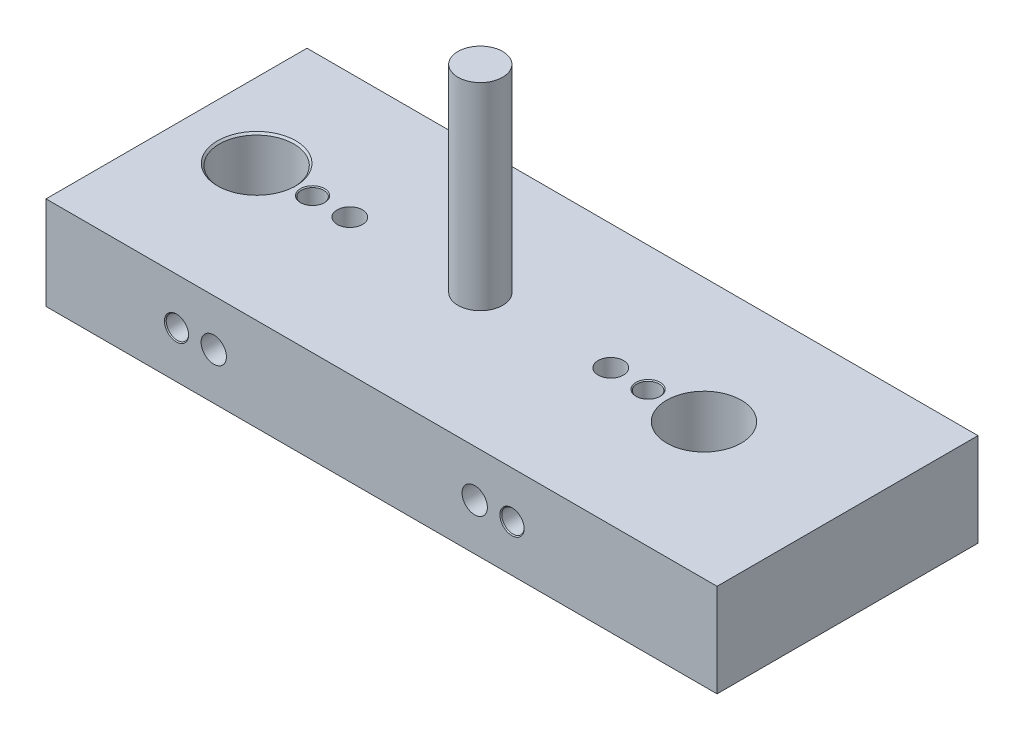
ISO-10303-21;
HEADER;
FILE_DESCRIPTION(('STEP AP214'),'2;1');
FILE_NAME('part.step','',(''),(''),'','','');
FILE_SCHEMA(('AUTOMOTIVE_DESIGN { 1 0 10303 214 1 1 1 1 }'));
ENDSEC;
DATA;
#1=APPLICATION_CONTEXT('core data for automotive mechanical design processes');
#2=APPLICATION_PROTOCOL_DEFINITION('international standard','automotive_design',2000,#1);
#3=PRODUCT_CONTEXT('',#1,'mechanical');
#4=PRODUCT('Part','Part','',(#3));
#5=PRODUCT_RELATED_PRODUCT_CATEGORY('part','',(#4));
#6=PRODUCT_DEFINITION_FORMATION('','',#4);
#7=PRODUCT_DEFINITION_CONTEXT('part definition',#1,'design');
#8=PRODUCT_DEFINITION('design','',#6,#7);
#9=PRODUCT_DEFINITION_SHAPE('','',#8);
#10=(LENGTH_UNIT() NAMED_UNIT(*) SI_UNIT(.MILLI.,.METRE.));
#11=(NAMED_UNIT(*) PLANE_ANGLE_UNIT() SI_UNIT($,.RADIAN.));
#12=(NAMED_UNIT(*) SI_UNIT($,.STERADIAN.) SOLID_ANGLE_UNIT());
#13=UNCERTAINTY_MEASURE_WITH_UNIT(LENGTH_MEASURE(1.E-05),#10,'distance_accuracy_value','');
#14=(GEOMETRIC_REPRESENTATION_CONTEXT(3) GLOBAL_UNCERTAINTY_ASSIGNED_CONTEXT((#13)) GLOBAL_UNIT_ASSIGNED_CONTEXT((#10,
#11,#12)) REPRESENTATION_CONTEXT('',''));
#15=CARTESIAN_POINT('',(0.,0.,0.));
#16=DIRECTION('',(0.,0.,1.));
#17=DIRECTION('',(1.,0.,0.));
#18=AXIS2_PLACEMENT_3D('',#15,#16,#17);
#19=CARTESIAN_POINT('',(0.,25.,-70.));
#20=DIRECTION('',(0.,-1.,0.));
#21=DIRECTION('',(0.,0.,-1.));
#22=AXIS2_PLACEMENT_3D('',#19,#20,#21);
#23=PLANE('',#22);
#24=CARTESIAN_POINT('',(140.,25.,-36.5));
#25=DIRECTION('',(0.,-1.,0.));
#26=DIRECTION('',(0.,0.,-1.));
#27=AXIS2_PLACEMENT_3D('',#24,#25,#26);
#28=CIRCLE('',#27,9.99999999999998);
#29=CARTESIAN_POINT('',(140.,25.,-46.5));
#30=VERTEX_POINT('',#29);
#31=EDGE_CURVE('E9178',#30,#30,#28,.T.);
#32=ORIENTED_EDGE('',*,*,#31,.T.);
#33=EDGE_LOOP('',(#32));
#34=FACE_BOUND('',#33,.T.);
#35=DIRECTION('',(0.,0.,1.));
#36=VECTOR('',#35,1.);
#37=CARTESIAN_POINT('',(0.,25.,0.));
#38=LINE('',#37,#36);
#39=CARTESIAN_POINT('',(0.,25.,-70.));
#40=VERTEX_POINT('',#39);
#41=CARTESIAN_POINT('',(0.,25.,0.));
#42=VERTEX_POINT('',#41);
#43=EDGE_CURVE('E9306',#40,#42,#38,.T.);
#44=ORIENTED_EDGE('',*,*,#43,.T.);
#45=DIRECTION('',(1.,0.,0.));
#46=VECTOR('',#45,1.);
#47=CARTESIAN_POINT('',(0.,25.,0.));
#48=LINE('',#47,#46);
#49=CARTESIAN_POINT('',(180.,25.,0.));
#50=VERTEX_POINT('',#49);
#51=EDGE_CURVE('E9304',#42,#50,#48,.T.);
#52=ORIENTED_EDGE('',*,*,#51,.T.);
#53=DIRECTION('',(0.,0.,-1.));
#54=VECTOR('',#53,1.);
#55=CARTESIAN_POINT('',(180.,25.,0.));
#56=LINE('',#55,#54);
#57=CARTESIAN_POINT('',(180.,25.,-70.));
#58=VERTEX_POINT('',#57);
#59=EDGE_CURVE('E9302',#50,#58,#56,.T.);
#60=ORIENTED_EDGE('',*,*,#59,.T.);
#61=DIRECTION('',(-1.,0.,0.));
#62=VECTOR('',#61,1.);
#63=CARTESIAN_POINT('',(0.,25.,-70.));
#64=LINE('',#63,#62);
#65=EDGE_CURVE('E9300',#58,#40,#64,.T.);
#66=ORIENTED_EDGE('',*,*,#65,.T.);
#67=EDGE_LOOP('',(#44,#52,#60,#66));
#68=FACE_BOUND('',#67,.T.);
#69=CARTESIAN_POINT('',(20.,25.,-36.5));
#70=DIRECTION('',(0.,-1.,0.));
#71=DIRECTION('',(0.,0.,-1.));
#72=AXIS2_PLACEMENT_3D('',#69,#70,#71);
#73=CIRCLE('',#72,10.5);
#74=CARTESIAN_POINT('',(20.,25.,-47.));
#75=VERTEX_POINT('',#74);
#76=EDGE_CURVE('E9327',#75,#75,#73,.T.);
#77=ORIENTED_EDGE('',*,*,#76,.T.);
#78=EDGE_LOOP('',(#77));
#79=FACE_BOUND('',#78,.T.);
#80=CARTESIAN_POINT('',(45.,25.,-36.5));
#81=DIRECTION('',(0.,-1.,0.));
#82=DIRECTION('',(0.,0.,-1.));
#83=AXIS2_PLACEMENT_3D('',#80,#81,#82);
#84=CIRCLE('',#83,3.39999999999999);
#85=CARTESIAN_POINT('',(45.,25.,-39.9));
#86=VERTEX_POINT('',#85);
#87=EDGE_CURVE('E9333',#86,#86,#84,.T.);
#88=ORIENTED_EDGE('',*,*,#87,.T.);
#89=EDGE_LOOP('',(#88));
#90=FACE_BOUND('',#89,.T.);
#91=CARTESIAN_POINT('',(115.,25.,-36.5));
#92=DIRECTION('',(0.,-1.,0.));
#93=DIRECTION('',(0.,0.,-1.));
#94=AXIS2_PLACEMENT_3D('',#91,#92,#93);
#95=CIRCLE('',#94,3.4);
#96=CARTESIAN_POINT('',(115.,25.,-39.9));
#97=VERTEX_POINT('',#96);
#98=EDGE_CURVE('E9339',#97,#97,#95,.T.);
#99=ORIENTED_EDGE('',*,*,#98,.T.);
#100=EDGE_LOOP('',(#99));
#101=FACE_BOUND('',#100,.T.);
#102=CARTESIAN_POINT('',(35.,25.,-36.5));
#103=DIRECTION('',(0.,-1.,0.));
#104=DIRECTION('',(0.,0.,-1.));
#105=AXIS2_PLACEMENT_3D('',#102,#103,#104);
#106=CIRCLE('',#105,3.25);
#107=CARTESIAN_POINT('',(35.,25.,-39.75));
#108=VERTEX_POINT('',#107);
#109=EDGE_CURVE('E9351',#108,#108,#106,.T.);
#110=ORIENTED_EDGE('',*,*,#109,.T.);
#111=EDGE_LOOP('',(#110));
#112=FACE_BOUND('',#111,.T.);
#113=CARTESIAN_POINT('',(125.,25.,-36.5));
#114=DIRECTION('',(0.,-1.,0.));
#115=DIRECTION('',(0.,0.,-1.));
#116=AXIS2_PLACEMENT_3D('',#113,#114,#115);
#117=CIRCLE('',#116,3.25);
#118=CARTESIAN_POINT('',(125.,25.,-39.75));
#119=VERTEX_POINT('',#118);
#120=EDGE_CURVE('E9363',#119,#119,#117,.T.);
#121=ORIENTED_EDGE('',*,*,#120,.T.);
#122=EDGE_LOOP('',(#121));
#123=FACE_BOUND('',#122,.T.);
#124=CARTESIAN_POINT('',(80.,25.,-36.5));
#125=DIRECTION('',(0.,-1.,0.));
#126=DIRECTION('',(0.,0.,-1.));
#127=AXIS2_PLACEMENT_3D('',#124,#125,#126);
#128=CIRCLE('',#127,6.);
#129=CARTESIAN_POINT('',(80.,25.,-42.5));
#130=VERTEX_POINT('',#129);
#131=EDGE_CURVE('E11',#130,#130,#128,.F.);
#132=ORIENTED_EDGE('',*,*,#131,.F.);
#133=EDGE_LOOP('',(#132));
#134=FACE_BOUND('',#133,.T.);
#135=ADVANCED_FACE('F9174',(#34,#68,#79,#90,#101,#112,#123,#134),#23,.F.);
#136=CARTESIAN_POINT('',(115.,0.,-36.5));
#137=DIRECTION('',(0.,-1.,0.));
#138=DIRECTION('',(0.,0.,-1.));
#139=AXIS2_PLACEMENT_3D('',#136,#137,#138);
#140=CYLINDRICAL_SURFACE('',#139,3.4);
#141=CARTESIAN_POINT('',(115.,0.,-36.5));
#142=DIRECTION('',(0.,-1.,0.));
#143=DIRECTION('',(0.,0.,-1.));
#144=AXIS2_PLACEMENT_3D('',#141,#142,#143);
#145=CIRCLE('',#144,3.4);
#146=CARTESIAN_POINT('',(115.,0.,-39.9));
#147=VERTEX_POINT('',#146);
#148=EDGE_CURVE('E9336',#147,#147,#145,.T.);
#149=ORIENTED_EDGE('',*,*,#148,.T.);
#150=EDGE_LOOP('',(#149));
#151=FACE_BOUND('',#150,.T.);
#152=CARTESIAN_POINT('',(115.,12.5,-36.5));
#153=DIRECTION('',(0.,-0.707106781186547,-0.707106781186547));
#154=DIRECTION('',(0.,-0.707106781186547,0.707106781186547));
#155=AXIS2_PLACEMENT_3D('',#152,#153,#154);
#156=ELLIPSE('',#155,4.80832611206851,3.39999999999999);
#157=CARTESIAN_POINT('',(111.6,12.5,-36.5));
#158=VERTEX_POINT('',#157);
#159=CARTESIAN_POINT('',(118.4,12.5,-36.5));
#160=VERTEX_POINT('',#159);
#161=EDGE_CURVE('E9189',#158,#160,#156,.F.);
#162=ORIENTED_EDGE('',*,*,#161,.T.);
#163=CARTESIAN_POINT('',(115.,12.5,-36.5));
#164=DIRECTION('',(0.,-0.707106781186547,0.707106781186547));
#165=DIRECTION('',(0.,-0.707106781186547,-0.707106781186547));
#166=AXIS2_PLACEMENT_3D('',#163,#164,#165);
#167=ELLIPSE('',#166,4.80832611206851,3.39999999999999);
#168=EDGE_CURVE('E9183',#160,#158,#167,.F.);
#169=ORIENTED_EDGE('',*,*,#168,.T.);
#170=EDGE_LOOP('',(#162,#169));
#171=FACE_BOUND('',#170,.T.);
#172=ADVANCED_FACE('F9252',(#151,#171),#140,.F.);
#173=CARTESIAN_POINT('',(45.,0.,-36.5));
#174=DIRECTION('',(0.,-1.,0.));
#175=DIRECTION('',(0.,0.,-1.));
#176=AXIS2_PLACEMENT_3D('',#173,#174,#175);
#177=CYLINDRICAL_SURFACE('',#176,3.4);
#178=CARTESIAN_POINT('',(45.,0.,-36.5));
#179=DIRECTION('',(0.,-1.,0.));
#180=DIRECTION('',(0.,0.,-1.));
#181=AXIS2_PLACEMENT_3D('',#178,#179,#180);
#182=CIRCLE('',#181,3.4);
#183=CARTESIAN_POINT('',(45.,0.,-39.9));
#184=VERTEX_POINT('',#183);
#185=EDGE_CURVE('E9330',#184,#184,#182,.T.);
#186=ORIENTED_EDGE('',*,*,#185,.T.);
#187=EDGE_LOOP('',(#186));
#188=FACE_BOUND('',#187,.T.);
#189=CARTESIAN_POINT('',(45.,12.5,-36.5));
#190=DIRECTION('',(0.,-0.707106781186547,-0.707106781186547));
#191=DIRECTION('',(0.,-0.707106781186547,0.707106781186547));
#192=AXIS2_PLACEMENT_3D('',#189,#190,#191);
#193=ELLIPSE('',#192,4.80832611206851,3.39999999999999);
#194=CARTESIAN_POINT('',(41.6,12.5,-36.5));
#195=VERTEX_POINT('',#194);
#196=CARTESIAN_POINT('',(48.4,12.5,-36.5));
#197=VERTEX_POINT('',#196);
#198=EDGE_CURVE('E9196',#195,#197,#193,.F.);
#199=ORIENTED_EDGE('',*,*,#198,.T.);
#200=CARTESIAN_POINT('',(45.,12.5,-36.5));
#201=DIRECTION('',(0.,-0.707106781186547,0.707106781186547));
#202=DIRECTION('',(0.,-0.707106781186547,-0.707106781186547));
#203=AXIS2_PLACEMENT_3D('',#200,#201,#202);
#204=ELLIPSE('',#203,4.80832611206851,3.39999999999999);
#205=EDGE_CURVE('E9250',#197,#195,#204,.F.);
#206=ORIENTED_EDGE('',*,*,#205,.T.);
#207=EDGE_LOOP('',(#199,#206));
#208=FACE_BOUND('',#207,.T.);
#209=ADVANCED_FACE('F9549',(#188,#208),#177,.F.);
#210=CARTESIAN_POINT('',(125.,0.,-36.5));
#211=DIRECTION('',(0.,-1.,0.));
#212=DIRECTION('',(0.,0.,-1.));
#213=AXIS2_PLACEMENT_3D('',#210,#211,#212);
#214=CYLINDRICAL_SURFACE('',#213,3.);
#215=CARTESIAN_POINT('',(125.,0.250000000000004,-36.5));
#216=DIRECTION('',(0.,-1.,0.));
#217=DIRECTION('',(0.,0.,-1.));
#218=AXIS2_PLACEMENT_3D('',#215,#216,#217);
#219=CIRCLE('',#218,3.);
#220=CARTESIAN_POINT('',(125.,0.250000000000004,-39.5));
#221=VERTEX_POINT('',#220);
#222=EDGE_CURVE('E9357',#221,#221,#219,.T.);
#223=ORIENTED_EDGE('',*,*,#222,.T.);
#224=EDGE_LOOP('',(#223));
#225=FACE_BOUND('',#224,.T.);
#226=CARTESIAN_POINT('',(125.,12.5,-36.5));
#227=DIRECTION('',(0.,-0.707106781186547,-0.707106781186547));
#228=DIRECTION('',(0.,-0.707106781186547,0.707106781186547));
#229=AXIS2_PLACEMENT_3D('',#226,#227,#228);
#230=ELLIPSE('',#229,4.24264068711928,3.);
#231=CARTESIAN_POINT('',(122.,12.5,-36.5));
#232=VERTEX_POINT('',#231);
#233=CARTESIAN_POINT('',(128.,12.5,-36.5));
#234=VERTEX_POINT('',#233);
#235=EDGE_CURVE('E9275',#232,#234,#230,.F.);
#236=ORIENTED_EDGE('',*,*,#235,.T.);
#237=CARTESIAN_POINT('',(125.,12.5,-36.5));
#238=DIRECTION('',(0.,-0.707106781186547,0.707106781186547));
#239=DIRECTION('',(0.,-0.707106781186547,-0.707106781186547));
#240=AXIS2_PLACEMENT_3D('',#237,#238,#239);
#241=ELLIPSE('',#240,4.24264068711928,3.);
#242=EDGE_CURVE('E9266',#234,#232,#241,.F.);
#243=ORIENTED_EDGE('',*,*,#242,.T.);
#244=EDGE_LOOP('',(#236,#243));
#245=FACE_BOUND('',#244,.T.);
#246=ADVANCED_FACE('F9525',(#225,#245),#214,.F.);
#247=CARTESIAN_POINT('',(35.,0.,-36.5));
#248=DIRECTION('',(0.,-1.,0.));
#249=DIRECTION('',(0.,0.,-1.));
#250=AXIS2_PLACEMENT_3D('',#247,#248,#249);
#251=CYLINDRICAL_SURFACE('',#250,3.);
#252=CARTESIAN_POINT('',(35.,0.250000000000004,-36.5));
#253=DIRECTION('',(0.,-1.,0.));
#254=DIRECTION('',(0.,0.,-1.));
#255=AXIS2_PLACEMENT_3D('',#252,#253,#254);
#256=CIRCLE('',#255,3.);
#257=CARTESIAN_POINT('',(35.,0.250000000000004,-39.5));
#258=VERTEX_POINT('',#257);
#259=EDGE_CURVE('E9345',#258,#258,#256,.T.);
#260=ORIENTED_EDGE('',*,*,#259,.T.);
#261=EDGE_LOOP('',(#260));
#262=FACE_BOUND('',#261,.T.);
#263=CARTESIAN_POINT('',(35.,12.5,-36.5));
#264=DIRECTION('',(0.,-0.707106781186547,-0.707106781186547));
#265=DIRECTION('',(0.,-0.707106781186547,0.707106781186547));
#266=AXIS2_PLACEMENT_3D('',#263,#264,#265);
#267=ELLIPSE('',#266,4.24264068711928,2.99999999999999);
#268=CARTESIAN_POINT('',(32.,12.5,-36.5));
#269=VERTEX_POINT('',#268);
#270=CARTESIAN_POINT('',(38.,12.5,-36.5));
#271=VERTEX_POINT('',#270);
#272=EDGE_CURVE('E9286',#269,#271,#267,.F.);
#273=ORIENTED_EDGE('',*,*,#272,.T.);
#274=CARTESIAN_POINT('',(35.,12.5,-36.5));
#275=DIRECTION('',(0.,-0.707106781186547,0.707106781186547));
#276=DIRECTION('',(0.,-0.707106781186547,-0.707106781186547));
#277=AXIS2_PLACEMENT_3D('',#274,#275,#276);
#278=ELLIPSE('',#277,4.24264068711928,2.99999999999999);
#279=EDGE_CURVE('E9277',#271,#269,#278,.F.);
#280=ORIENTED_EDGE('',*,*,#279,.T.);
#281=EDGE_LOOP('',(#273,#280));
#282=FACE_BOUND('',#281,.T.);
#283=ADVANCED_FACE('F9538',(#262,#282),#251,.F.);
#284=CARTESIAN_POINT('',(0.,25.,0.));
#285=DIRECTION('',(1.,0.,0.));
#286=DIRECTION('',(0.,0.,-1.));
#287=AXIS2_PLACEMENT_3D('',#284,#285,#286);
#288=PLANE('',#287);
#289=DIRECTION('',(0.,0.,1.));
#290=VECTOR('',#289,1.);
#291=CARTESIAN_POINT('',(0.,0.,0.));
#292=LINE('',#291,#290);
#293=CARTESIAN_POINT('',(0.,0.,-70.));
#294=VERTEX_POINT('',#293);
#295=CARTESIAN_POINT('',(0.,0.,0.));
#296=VERTEX_POINT('',#295);
#297=EDGE_CURVE('E9315',#294,#296,#292,.T.);
#298=ORIENTED_EDGE('',*,*,#297,.T.);
#299=DIRECTION('',(0.,-1.,0.));
#300=VECTOR('',#299,1.);
#301=CARTESIAN_POINT('',(0.,25.,0.));
#302=LINE('',#301,#300);
#303=EDGE_CURVE('E9288',#42,#296,#302,.T.);
#304=ORIENTED_EDGE('',*,*,#303,.F.);
#305=ORIENTED_EDGE('',*,*,#43,.F.);
#306=DIRECTION('',(0.,-1.,0.));
#307=VECTOR('',#306,1.);
#308=CARTESIAN_POINT('',(0.,25.,-70.));
#309=LINE('',#308,#307);
#310=EDGE_CURVE('E9297',#40,#294,#309,.T.);
#311=ORIENTED_EDGE('',*,*,#310,.T.);
#312=EDGE_LOOP('',(#298,#304,#305,#311));
#313=FACE_BOUND('',#312,.T.);
#314=ADVANCED_FACE('F9176',(#313),#288,.F.);
#315=CARTESIAN_POINT('',(0.,25.,0.));
#316=DIRECTION('',(0.,0.,-1.));
#317=DIRECTION('',(-1.,0.,0.));
#318=AXIS2_PLACEMENT_3D('',#315,#316,#317);
#319=PLANE('',#318);
#320=CARTESIAN_POINT('',(115.,12.5,0.));
#321=DIRECTION('',(0.,0.,1.));
#322=DIRECTION('',(1.,0.,0.));
#323=AXIS2_PLACEMENT_3D('',#320,#321,#322);
#324=CIRCLE('',#323,3.39999999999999);
#325=CARTESIAN_POINT('',(118.4,12.5,0.));
#326=VERTEX_POINT('',#325);
#327=EDGE_CURVE('E9396',#326,#326,#324,.T.);
#328=ORIENTED_EDGE('',*,*,#327,.F.);
#329=EDGE_LOOP('',(#328));
#330=FACE_BOUND('',#329,.T.);
#331=CARTESIAN_POINT('',(45.,12.5,0.));
#332=DIRECTION('',(0.,0.,1.));
#333=DIRECTION('',(1.,0.,0.));
#334=AXIS2_PLACEMENT_3D('',#331,#332,#333);
#335=CIRCLE('',#334,3.39999999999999);
#336=CARTESIAN_POINT('',(48.4,12.5,0.));
#337=VERTEX_POINT('',#336);
#338=EDGE_CURVE('E9390',#337,#337,#335,.T.);
#339=ORIENTED_EDGE('',*,*,#338,.F.);
#340=EDGE_LOOP('',(#339));
#341=FACE_BOUND('',#340,.T.);
#342=CARTESIAN_POINT('',(125.,12.5,0.));
#343=DIRECTION('',(0.,0.,1.));
#344=DIRECTION('',(1.,0.,0.));
#345=AXIS2_PLACEMENT_3D('',#342,#343,#344);
#346=CIRCLE('',#345,3.25);
#347=CARTESIAN_POINT('',(128.25,12.5,0.));
#348=VERTEX_POINT('',#347);
#349=EDGE_CURVE('E9378',#348,#348,#346,.T.);
#350=ORIENTED_EDGE('',*,*,#349,.F.);
#351=EDGE_LOOP('',(#350));
#352=FACE_BOUND('',#351,.T.);
#353=CARTESIAN_POINT('',(35.,12.5,0.));
#354=DIRECTION('',(0.,0.,1.));
#355=DIRECTION('',(1.,0.,0.));
#356=AXIS2_PLACEMENT_3D('',#353,#354,#355);
#357=CIRCLE('',#356,3.25);
#358=CARTESIAN_POINT('',(38.25,12.5,0.));
#359=VERTEX_POINT('',#358);
#360=EDGE_CURVE('E9366',#359,#359,#357,.T.);
#361=ORIENTED_EDGE('',*,*,#360,.F.);
#362=EDGE_LOOP('',(#361));
#363=FACE_BOUND('',#362,.T.);
#364=DIRECTION('',(1.,0.,0.));
#365=VECTOR('',#364,1.);
#366=CARTESIAN_POINT('',(0.,0.,0.));
#367=LINE('',#366,#365);
#368=CARTESIAN_POINT('',(180.,0.,0.));
#369=VERTEX_POINT('',#368);
#370=EDGE_CURVE('E9313',#296,#369,#367,.T.);
#371=ORIENTED_EDGE('',*,*,#370,.T.);
#372=DIRECTION('',(0.,-1.,0.));
#373=VECTOR('',#372,1.);
#374=CARTESIAN_POINT('',(180.,25.,0.));
#375=LINE('',#374,#373);
#376=EDGE_CURVE('E9291',#50,#369,#375,.T.);
#377=ORIENTED_EDGE('',*,*,#376,.F.);
#378=ORIENTED_EDGE('',*,*,#51,.F.);
#379=ORIENTED_EDGE('',*,*,#303,.T.);
#380=EDGE_LOOP('',(#371,#377,#378,#379));
#381=FACE_BOUND('',#380,.T.);
#382=ADVANCED_FACE('F9452',(#330,#341,#352,#363,#381),#319,.F.);
#383=CARTESIAN_POINT('',(180.,25.,0.));
#384=DIRECTION('',(-1.,0.,0.));
#385=DIRECTION('',(0.,0.,1.));
#386=AXIS2_PLACEMENT_3D('',#383,#384,#385);
#387=PLANE('',#386);
#388=DIRECTION('',(0.,0.,-1.));
#389=VECTOR('',#388,1.);
#390=CARTESIAN_POINT('',(180.,0.,0.));
#391=LINE('',#390,#389);
#392=CARTESIAN_POINT('',(180.,0.,-70.));
#393=VERTEX_POINT('',#392);
#394=EDGE_CURVE('E9311',#369,#393,#391,.T.);
#395=ORIENTED_EDGE('',*,*,#394,.T.);
#396=DIRECTION('',(0.,-1.,0.));
#397=VECTOR('',#396,1.);
#398=CARTESIAN_POINT('',(180.,25.,-70.));
#399=LINE('',#398,#397);
#400=EDGE_CURVE('E9294',#58,#393,#399,.T.);
#401=ORIENTED_EDGE('',*,*,#400,.F.);
#402=ORIENTED_EDGE('',*,*,#59,.F.);
#403=ORIENTED_EDGE('',*,*,#376,.T.);
#404=EDGE_LOOP('',(#395,#401,#402,#403));
#405=FACE_BOUND('',#404,.T.);
#406=ADVANCED_FACE('F9449',(#405),#387,.F.);
#407=CARTESIAN_POINT('',(0.,25.,-70.));
#408=DIRECTION('',(0.,0.,1.));
#409=DIRECTION('',(1.,0.,0.));
#410=AXIS2_PLACEMENT_3D('',#407,#408,#409);
#411=PLANE('',#410);
#412=CARTESIAN_POINT('',(115.,12.5,-70.));
#413=DIRECTION('',(0.,0.,1.));
#414=DIRECTION('',(1.,0.,0.));
#415=AXIS2_PLACEMENT_3D('',#412,#413,#414);
#416=CIRCLE('',#415,3.39999999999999);
#417=CARTESIAN_POINT('',(118.4,12.5,-70.));
#418=VERTEX_POINT('',#417);
#419=EDGE_CURVE('E9399',#418,#418,#416,.T.);
#420=ORIENTED_EDGE('',*,*,#419,.T.);
#421=EDGE_LOOP('',(#420));
#422=FACE_BOUND('',#421,.T.);
#423=CARTESIAN_POINT('',(45.,12.5,-70.));
#424=DIRECTION('',(0.,0.,1.));
#425=DIRECTION('',(1.,0.,0.));
#426=AXIS2_PLACEMENT_3D('',#423,#424,#425);
#427=CIRCLE('',#426,3.39999999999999);
#428=CARTESIAN_POINT('',(48.4,12.5,-70.));
#429=VERTEX_POINT('',#428);
#430=EDGE_CURVE('E9393',#429,#429,#427,.T.);
#431=ORIENTED_EDGE('',*,*,#430,.T.);
#432=EDGE_LOOP('',(#431));
#433=FACE_BOUND('',#432,.T.);
#434=CARTESIAN_POINT('',(125.,12.5,-70.));
#435=DIRECTION('',(0.,0.,1.));
#436=DIRECTION('',(1.,0.,0.));
#437=AXIS2_PLACEMENT_3D('',#434,#435,#436);
#438=CIRCLE('',#437,3.24999999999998);
#439=CARTESIAN_POINT('',(128.25,12.5,-70.));
#440=VERTEX_POINT('',#439);
#441=EDGE_CURVE('E9387',#440,#440,#438,.T.);
#442=ORIENTED_EDGE('',*,*,#441,.T.);
#443=EDGE_LOOP('',(#442));
#444=FACE_BOUND('',#443,.T.);
#445=CARTESIAN_POINT('',(35.,12.5,-70.));
#446=DIRECTION('',(0.,0.,1.));
#447=DIRECTION('',(1.,0.,0.));
#448=AXIS2_PLACEMENT_3D('',#445,#446,#447);
#449=CIRCLE('',#448,3.24999999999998);
#450=CARTESIAN_POINT('',(38.25,12.5,-70.));
#451=VERTEX_POINT('',#450);
#452=EDGE_CURVE('E9375',#451,#451,#449,.T.);
#453=ORIENTED_EDGE('',*,*,#452,.T.);
#454=EDGE_LOOP('',(#453));
#455=FACE_BOUND('',#454,.T.);
#456=DIRECTION('',(-1.,0.,0.));
#457=VECTOR('',#456,1.);
#458=CARTESIAN_POINT('',(0.,0.,-70.));
#459=LINE('',#458,#457);
#460=EDGE_CURVE('E9309',#393,#294,#459,.T.);
#461=ORIENTED_EDGE('',*,*,#460,.T.);
#462=ORIENTED_EDGE('',*,*,#310,.F.);
#463=ORIENTED_EDGE('',*,*,#65,.F.);
#464=ORIENTED_EDGE('',*,*,#400,.T.);
#465=EDGE_LOOP('',(#461,#462,#463,#464));
#466=FACE_BOUND('',#465,.T.);
#467=ADVANCED_FACE('F9425',(#422,#433,#444,#455,#466),#411,.F.);
#468=CARTESIAN_POINT('',(0.,0.,-70.));
#469=DIRECTION('',(0.,-1.,0.));
#470=DIRECTION('',(0.,0.,-1.));
#471=AXIS2_PLACEMENT_3D('',#468,#469,#470);
#472=PLANE('',#471);
#473=CARTESIAN_POINT('',(140.,0.,-36.5));
#474=DIRECTION('',(0.,-1.,0.));
#475=DIRECTION('',(0.,0.,-1.));
#476=AXIS2_PLACEMENT_3D('',#473,#474,#475);
#477=CIRCLE('',#476,10.5);
#478=CARTESIAN_POINT('',(140.,0.,-47.));
#479=VERTEX_POINT('',#478);
#480=EDGE_CURVE('E9405',#479,#479,#477,.T.);
#481=ORIENTED_EDGE('',*,*,#480,.F.);
#482=EDGE_LOOP('',(#481));
#483=FACE_BOUND('',#482,.T.);
#484=CARTESIAN_POINT('',(125.,0.,-36.5));
#485=DIRECTION('',(0.,-1.,0.));
#486=DIRECTION('',(0.,0.,-1.));
#487=AXIS2_PLACEMENT_3D('',#484,#485,#486);
#488=CIRCLE('',#487,3.25);
#489=CARTESIAN_POINT('',(125.,0.,-39.75));
#490=VERTEX_POINT('',#489);
#491=EDGE_CURVE('E9354',#490,#490,#488,.T.);
#492=ORIENTED_EDGE('',*,*,#491,.F.);
#493=EDGE_LOOP('',(#492));
#494=FACE_BOUND('',#493,.T.);
#495=CARTESIAN_POINT('',(35.,0.,-36.5));
#496=DIRECTION('',(0.,-1.,0.));
#497=DIRECTION('',(0.,0.,-1.));
#498=AXIS2_PLACEMENT_3D('',#495,#496,#497);
#499=CIRCLE('',#498,3.25);
#500=CARTESIAN_POINT('',(35.,0.,-39.75));
#501=VERTEX_POINT('',#500);
#502=EDGE_CURVE('E9342',#501,#501,#499,.T.);
#503=ORIENTED_EDGE('',*,*,#502,.F.);
#504=EDGE_LOOP('',(#503));
#505=FACE_BOUND('',#504,.T.);
#506=ORIENTED_EDGE('',*,*,#148,.F.);
#507=EDGE_LOOP('',(#506));
#508=FACE_BOUND('',#507,.T.);
#509=ORIENTED_EDGE('',*,*,#185,.F.);
#510=EDGE_LOOP('',(#509));
#511=FACE_BOUND('',#510,.T.);
#512=CARTESIAN_POINT('',(20.,0.,-36.5));
#513=DIRECTION('',(0.,-1.,0.));
#514=DIRECTION('',(0.,0.,-1.));
#515=AXIS2_PLACEMENT_3D('',#512,#513,#514);
#516=CIRCLE('',#515,10.5);
#517=CARTESIAN_POINT('',(20.,0.,-47.));
#518=VERTEX_POINT('',#517);
#519=EDGE_CURVE('E9318',#518,#518,#516,.T.);
#520=ORIENTED_EDGE('',*,*,#519,.F.);
#521=EDGE_LOOP('',(#520));
#522=FACE_BOUND('',#521,.T.);
#523=ORIENTED_EDGE('',*,*,#297,.F.);
#524=ORIENTED_EDGE('',*,*,#460,.F.);
#525=ORIENTED_EDGE('',*,*,#394,.F.);
#526=ORIENTED_EDGE('',*,*,#370,.F.);
#527=EDGE_LOOP('',(#523,#524,#525,#526));
#528=FACE_BOUND('',#527,.T.);
#529=ADVANCED_FACE('F9421',(#483,#494,#505,#508,#511,#522,#528),#472,.T.);
#530=CARTESIAN_POINT('',(20.,0.,-36.5));
#531=DIRECTION('',(0.,-1.,0.));
#532=DIRECTION('',(0.,0.,-1.));
#533=AXIS2_PLACEMENT_3D('',#530,#531,#532);
#534=CONICAL_SURFACE('',#533,10.5,0.785398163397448);
#535=CARTESIAN_POINT('',(20.,0.500000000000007,-36.5));
#536=DIRECTION('',(0.,-1.,0.));
#537=DIRECTION('',(0.,0.,-1.));
#538=AXIS2_PLACEMENT_3D('',#535,#536,#537);
#539=CIRCLE('',#538,9.99999999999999);
#540=CARTESIAN_POINT('',(20.,0.500000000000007,-46.5));
#541=VERTEX_POINT('',#540);
#542=EDGE_CURVE('E9321',#541,#541,#539,.T.);
#543=ORIENTED_EDGE('',*,*,#542,.F.);
#544=EDGE_LOOP('',(#543));
#545=FACE_BOUND('',#544,.T.);
#546=ORIENTED_EDGE('',*,*,#519,.T.);
#547=EDGE_LOOP('',(#546));
#548=FACE_BOUND('',#547,.T.);
#549=ADVANCED_FACE('F9424',(#545,#548),#534,.F.);
#550=CARTESIAN_POINT('',(20.,0.,-36.5));
#551=DIRECTION('',(0.,-1.,0.));
#552=DIRECTION('',(0.,0.,-1.));
#553=AXIS2_PLACEMENT_3D('',#550,#551,#552);
#554=CYLINDRICAL_SURFACE('',#553,9.99999999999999);
#555=CARTESIAN_POINT('',(20.,24.5,-36.5));
#556=DIRECTION('',(0.,-1.,0.));
#557=DIRECTION('',(0.,0.,-1.));
#558=AXIS2_PLACEMENT_3D('',#555,#556,#557);
#559=CIRCLE('',#558,9.99999999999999);
#560=CARTESIAN_POINT('',(20.,24.5,-46.5));
#561=VERTEX_POINT('',#560);
#562=EDGE_CURVE('E9324',#561,#561,#559,.T.);
#563=ORIENTED_EDGE('',*,*,#562,.F.);
#564=EDGE_LOOP('',(#563));
#565=FACE_BOUND('',#564,.T.);
#566=ORIENTED_EDGE('',*,*,#542,.T.);
#567=EDGE_LOOP('',(#566));
#568=FACE_BOUND('',#567,.T.);
#569=ADVANCED_FACE('F9552',(#565,#568),#554,.F.);
#570=CARTESIAN_POINT('',(20.,24.5,-36.5));
#571=DIRECTION('',(0.,1.,0.));
#572=DIRECTION('',(0.,0.,1.));
#573=AXIS2_PLACEMENT_3D('',#570,#571,#572);
#574=CONICAL_SURFACE('',#573,9.99999999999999,0.785398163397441);
#575=ORIENTED_EDGE('',*,*,#76,.F.);
#576=EDGE_LOOP('',(#575));
#577=FACE_BOUND('',#576,.T.);
#578=ORIENTED_EDGE('',*,*,#562,.T.);
#579=EDGE_LOOP('',(#578));
#580=FACE_BOUND('',#579,.T.);
#581=ADVANCED_FACE('F9547',(#577,#580),#574,.F.);
#582=CARTESIAN_POINT('',(45.,12.5,-36.5));
#583=DIRECTION('',(0.,-0.707106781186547,-0.707106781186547));
#584=DIRECTION('',(0.,-0.707106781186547,0.707106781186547));
#585=AXIS2_PLACEMENT_3D('',#582,#583,#584);
#586=ELLIPSE('',#585,4.80832611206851,3.39999999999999);
#587=EDGE_CURVE('E9262',#195,#197,#586,.T.);
#588=ORIENTED_EDGE('',*,*,#587,.T.);
#589=CARTESIAN_POINT('',(45.,12.5,-36.5));
#590=DIRECTION('',(0.,-0.707106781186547,0.707106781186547));
#591=DIRECTION('',(0.,-0.707106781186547,-0.707106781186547));
#592=AXIS2_PLACEMENT_3D('',#589,#590,#591);
#593=ELLIPSE('',#592,4.80832611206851,3.39999999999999);
#594=EDGE_CURVE('E9259',#197,#195,#593,.T.);
#595=ORIENTED_EDGE('',*,*,#594,.T.);
#596=EDGE_LOOP('',(#588,#595));
#597=FACE_BOUND('',#596,.T.);
#598=ORIENTED_EDGE('',*,*,#87,.F.);
#599=EDGE_LOOP('',(#598));
#600=FACE_BOUND('',#599,.T.);
#601=ADVANCED_FACE('F9544',(#597,#600),#177,.F.);
#602=CARTESIAN_POINT('',(115.,12.5,-36.5));
#603=DIRECTION('',(0.,-0.707106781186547,-0.707106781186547));
#604=DIRECTION('',(0.,-0.707106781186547,0.707106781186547));
#605=AXIS2_PLACEMENT_3D('',#602,#603,#604);
#606=ELLIPSE('',#605,4.80832611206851,3.39999999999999);
#607=EDGE_CURVE('E9242',#158,#160,#606,.T.);
#608=ORIENTED_EDGE('',*,*,#607,.T.);
#609=CARTESIAN_POINT('',(115.,12.5,-36.5));
#610=DIRECTION('',(0.,-0.707106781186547,0.707106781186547));
#611=DIRECTION('',(0.,-0.707106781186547,-0.707106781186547));
#612=AXIS2_PLACEMENT_3D('',#609,#610,#611);
#613=ELLIPSE('',#612,4.80832611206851,3.39999999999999);
#614=EDGE_CURVE('E9246',#160,#158,#613,.T.);
#615=ORIENTED_EDGE('',*,*,#614,.T.);
#616=EDGE_LOOP('',(#608,#615));
#617=FACE_BOUND('',#616,.T.);
#618=ORIENTED_EDGE('',*,*,#98,.F.);
#619=EDGE_LOOP('',(#618));
#620=FACE_BOUND('',#619,.T.);
#621=ADVANCED_FACE('F9254',(#617,#620),#140,.F.);
#622=CARTESIAN_POINT('',(35.,0.,-36.5));
#623=DIRECTION('',(0.,-1.,0.));
#624=DIRECTION('',(0.,0.,-1.));
#625=AXIS2_PLACEMENT_3D('',#622,#623,#624);
#626=CONICAL_SURFACE('',#625,3.25,0.785398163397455);
#627=ORIENTED_EDGE('',*,*,#259,.F.);
#628=EDGE_LOOP('',(#627));
#629=FACE_BOUND('',#628,.T.);
#630=ORIENTED_EDGE('',*,*,#502,.T.);
#631=EDGE_LOOP('',(#630));
#632=FACE_BOUND('',#631,.T.);
#633=ADVANCED_FACE('F9536',(#629,#632),#626,.F.);
#634=CARTESIAN_POINT('',(35.,12.5,-36.5));
#635=DIRECTION('',(0.,-0.707106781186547,-0.707106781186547));
#636=DIRECTION('',(0.,-0.707106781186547,0.707106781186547));
#637=AXIS2_PLACEMENT_3D('',#634,#635,#636);
#638=ELLIPSE('',#637,4.24264068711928,2.99999999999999);
#639=EDGE_CURVE('E9283',#269,#271,#638,.T.);
#640=ORIENTED_EDGE('',*,*,#639,.T.);
#641=CARTESIAN_POINT('',(35.,12.5,-36.5));
#642=DIRECTION('',(0.,-0.707106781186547,0.707106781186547));
#643=DIRECTION('',(0.,-0.707106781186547,-0.707106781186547));
#644=AXIS2_PLACEMENT_3D('',#641,#642,#643);
#645=ELLIPSE('',#644,4.24264068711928,2.99999999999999);
#646=EDGE_CURVE('E9280',#271,#269,#645,.T.);
#647=ORIENTED_EDGE('',*,*,#646,.T.);
#648=EDGE_LOOP('',(#640,#647));
#649=FACE_BOUND('',#648,.T.);
#650=CARTESIAN_POINT('',(35.,24.75,-36.5));
#651=DIRECTION('',(0.,-1.,0.));
#652=DIRECTION('',(0.,0.,-1.));
#653=AXIS2_PLACEMENT_3D('',#650,#651,#652);
#654=CIRCLE('',#653,3.);
#655=CARTESIAN_POINT('',(35.,24.75,-39.5));
#656=VERTEX_POINT('',#655);
#657=EDGE_CURVE('E9348',#656,#656,#654,.T.);
#658=ORIENTED_EDGE('',*,*,#657,.F.);
#659=EDGE_LOOP('',(#658));
#660=FACE_BOUND('',#659,.T.);
#661=ADVANCED_FACE('F9532',(#649,#660),#251,.F.);
#662=CARTESIAN_POINT('',(35.,24.75,-36.5));
#663=DIRECTION('',(0.,1.,0.));
#664=DIRECTION('',(0.,0.,1.));
#665=AXIS2_PLACEMENT_3D('',#662,#663,#664);
#666=CONICAL_SURFACE('',#665,3.,0.785398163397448);
#667=ORIENTED_EDGE('',*,*,#109,.F.);
#668=EDGE_LOOP('',(#667));
#669=FACE_BOUND('',#668,.T.);
#670=ORIENTED_EDGE('',*,*,#657,.T.);
#671=EDGE_LOOP('',(#670));
#672=FACE_BOUND('',#671,.T.);
#673=ADVANCED_FACE('F9528',(#669,#672),#666,.F.);
#674=CARTESIAN_POINT('',(125.,0.,-36.5));
#675=DIRECTION('',(0.,-1.,0.));
#676=DIRECTION('',(0.,0.,-1.));
#677=AXIS2_PLACEMENT_3D('',#674,#675,#676);
#678=CONICAL_SURFACE('',#677,3.25,0.785398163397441);
#679=ORIENTED_EDGE('',*,*,#222,.F.);
#680=EDGE_LOOP('',(#679));
#681=FACE_BOUND('',#680,.T.);
#682=ORIENTED_EDGE('',*,*,#491,.T.);
#683=EDGE_LOOP('',(#682));
#684=FACE_BOUND('',#683,.T.);
#685=ADVANCED_FACE('F9523',(#681,#684),#678,.F.);
#686=CARTESIAN_POINT('',(125.,12.5,-36.5));
#687=DIRECTION('',(0.,-0.707106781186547,-0.707106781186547));
#688=DIRECTION('',(0.,-0.707106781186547,0.707106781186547));
#689=AXIS2_PLACEMENT_3D('',#686,#687,#688);
#690=ELLIPSE('',#689,4.24264068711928,3.);
#691=EDGE_CURVE('E9272',#232,#234,#690,.T.);
#692=ORIENTED_EDGE('',*,*,#691,.T.);
#693=CARTESIAN_POINT('',(125.,12.5,-36.5));
#694=DIRECTION('',(0.,-0.707106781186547,0.707106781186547));
#695=DIRECTION('',(0.,-0.707106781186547,-0.707106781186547));
#696=AXIS2_PLACEMENT_3D('',#693,#694,#695);
#697=ELLIPSE('',#696,4.24264068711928,3.);
#698=EDGE_CURVE('E9269',#234,#232,#697,.T.);
#699=ORIENTED_EDGE('',*,*,#698,.T.);
#700=EDGE_LOOP('',(#692,#699));
#701=FACE_BOUND('',#700,.T.);
#702=CARTESIAN_POINT('',(125.,24.75,-36.5));
#703=DIRECTION('',(0.,-1.,0.));
#704=DIRECTION('',(0.,0.,-1.));
#705=AXIS2_PLACEMENT_3D('',#702,#703,#704);
#706=CIRCLE('',#705,3.);
#707=CARTESIAN_POINT('',(125.,24.75,-39.5));
#708=VERTEX_POINT('',#707);
#709=EDGE_CURVE('E9360',#708,#708,#706,.T.);
#710=ORIENTED_EDGE('',*,*,#709,.F.);
#711=EDGE_LOOP('',(#710));
#712=FACE_BOUND('',#711,.T.);
#713=ADVANCED_FACE('F9519',(#701,#712),#214,.F.);
#714=CARTESIAN_POINT('',(125.,24.75,-36.5));
#715=DIRECTION('',(0.,1.,0.));
#716=DIRECTION('',(0.,0.,1.));
#717=AXIS2_PLACEMENT_3D('',#714,#715,#716);
#718=CONICAL_SURFACE('',#717,3.,0.785398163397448);
#719=ORIENTED_EDGE('',*,*,#120,.F.);
#720=EDGE_LOOP('',(#719));
#721=FACE_BOUND('',#720,.T.);
#722=ORIENTED_EDGE('',*,*,#709,.T.);
#723=EDGE_LOOP('',(#722));
#724=FACE_BOUND('',#723,.T.);
#725=ADVANCED_FACE('F9516',(#721,#724),#718,.F.);
#726=CARTESIAN_POINT('',(35.,12.5,0.));
#727=DIRECTION('',(0.,0.,1.));
#728=DIRECTION('',(1.,0.,0.));
#729=AXIS2_PLACEMENT_3D('',#726,#727,#728);
#730=CYLINDRICAL_SURFACE('',#729,2.99999999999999);
#731=CARTESIAN_POINT('',(35.,12.5,-0.250000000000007));
#732=DIRECTION('',(0.,0.,1.));
#733=DIRECTION('',(1.,0.,0.));
#734=AXIS2_PLACEMENT_3D('',#731,#732,#733);
#735=CIRCLE('',#734,3.);
#736=CARTESIAN_POINT('',(38.,12.5,-0.250000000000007));
#737=VERTEX_POINT('',#736);
#738=EDGE_CURVE('E9369',#737,#737,#735,.T.);
#739=ORIENTED_EDGE('',*,*,#738,.T.);
#740=EDGE_LOOP('',(#739));
#741=FACE_BOUND('',#740,.T.);
#742=ORIENTED_EDGE('',*,*,#272,.F.);
#743=ORIENTED_EDGE('',*,*,#646,.F.);
#744=EDGE_LOOP('',(#742,#743));
#745=FACE_BOUND('',#744,.T.);
#746=ADVANCED_FACE('F9512',(#741,#745),#730,.F.);
#747=CARTESIAN_POINT('',(35.,12.5,0.));
#748=DIRECTION('',(0.,0.,1.));
#749=DIRECTION('',(1.,0.,0.));
#750=AXIS2_PLACEMENT_3D('',#747,#748,#749);
#751=CONICAL_SURFACE('',#750,3.25,0.785398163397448);
#752=ORIENTED_EDGE('',*,*,#738,.F.);
#753=EDGE_LOOP('',(#752));
#754=FACE_BOUND('',#753,.T.);
#755=ORIENTED_EDGE('',*,*,#360,.T.);
#756=EDGE_LOOP('',(#755));
#757=FACE_BOUND('',#756,.T.);
#758=ADVANCED_FACE('F9510',(#754,#757),#751,.F.);
#759=CARTESIAN_POINT('',(35.,12.5,-69.75));
#760=DIRECTION('',(0.,0.,1.));
#761=DIRECTION('',(1.,0.,0.));
#762=AXIS2_PLACEMENT_3D('',#759,#760,#761);
#763=CIRCLE('',#762,2.99999999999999);
#764=CARTESIAN_POINT('',(38.,12.5,-69.75));
#765=VERTEX_POINT('',#764);
#766=EDGE_CURVE('E9372',#765,#765,#763,.T.);
#767=ORIENTED_EDGE('',*,*,#766,.F.);
#768=EDGE_LOOP('',(#767));
#769=FACE_BOUND('',#768,.T.);
#770=ORIENTED_EDGE('',*,*,#639,.F.);
#771=ORIENTED_EDGE('',*,*,#279,.F.);
#772=EDGE_LOOP('',(#770,#771));
#773=FACE_BOUND('',#772,.T.);
#774=ADVANCED_FACE('F9506',(#769,#773),#730,.F.);
#775=CARTESIAN_POINT('',(35.,12.5,-69.75));
#776=DIRECTION('',(0.,0.,-1.));
#777=DIRECTION('',(-1.,0.,0.));
#778=AXIS2_PLACEMENT_3D('',#775,#776,#777);
#779=CONICAL_SURFACE('',#778,2.99999999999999,0.785398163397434);
#780=ORIENTED_EDGE('',*,*,#452,.F.);
#781=EDGE_LOOP('',(#780));
#782=FACE_BOUND('',#781,.T.);
#783=ORIENTED_EDGE('',*,*,#766,.T.);
#784=EDGE_LOOP('',(#783));
#785=FACE_BOUND('',#784,.T.);
#786=ADVANCED_FACE('F9503',(#782,#785),#779,.F.);
#787=CARTESIAN_POINT('',(125.,12.5,0.));
#788=DIRECTION('',(0.,0.,1.));
#789=DIRECTION('',(1.,0.,0.));
#790=AXIS2_PLACEMENT_3D('',#787,#788,#789);
#791=CYLINDRICAL_SURFACE('',#790,2.99999999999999);
#792=CARTESIAN_POINT('',(125.,12.5,-0.250000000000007));
#793=DIRECTION('',(0.,0.,1.));
#794=DIRECTION('',(1.,0.,0.));
#795=AXIS2_PLACEMENT_3D('',#792,#793,#794);
#796=CIRCLE('',#795,3.);
#797=CARTESIAN_POINT('',(128.,12.5,-0.250000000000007));
#798=VERTEX_POINT('',#797);
#799=EDGE_CURVE('E9381',#798,#798,#796,.T.);
#800=ORIENTED_EDGE('',*,*,#799,.T.);
#801=EDGE_LOOP('',(#800));
#802=FACE_BOUND('',#801,.T.);
#803=ORIENTED_EDGE('',*,*,#235,.F.);
#804=ORIENTED_EDGE('',*,*,#698,.F.);
#805=EDGE_LOOP('',(#803,#804));
#806=FACE_BOUND('',#805,.T.);
#807=ADVANCED_FACE('F9499',(#802,#806),#791,.F.);
#808=CARTESIAN_POINT('',(125.,12.5,0.));
#809=DIRECTION('',(0.,0.,1.));
#810=DIRECTION('',(1.,0.,0.));
#811=AXIS2_PLACEMENT_3D('',#808,#809,#810);
#812=CONICAL_SURFACE('',#811,3.25,0.785398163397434);
#813=ORIENTED_EDGE('',*,*,#799,.F.);
#814=EDGE_LOOP('',(#813));
#815=FACE_BOUND('',#814,.T.);
#816=ORIENTED_EDGE('',*,*,#349,.T.);
#817=EDGE_LOOP('',(#816));
#818=FACE_BOUND('',#817,.T.);
#819=ADVANCED_FACE('F9497',(#815,#818),#812,.F.);
#820=CARTESIAN_POINT('',(125.,12.5,-69.75));
#821=DIRECTION('',(0.,0.,1.));
#822=DIRECTION('',(1.,0.,0.));
#823=AXIS2_PLACEMENT_3D('',#820,#821,#822);
#824=CIRCLE('',#823,2.99999999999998);
#825=CARTESIAN_POINT('',(128.,12.5,-69.75));
#826=VERTEX_POINT('',#825);
#827=EDGE_CURVE('E9384',#826,#826,#824,.T.);
#828=ORIENTED_EDGE('',*,*,#827,.F.);
#829=EDGE_LOOP('',(#828));
#830=FACE_BOUND('',#829,.T.);
#831=ORIENTED_EDGE('',*,*,#691,.F.);
#832=ORIENTED_EDGE('',*,*,#242,.F.);
#833=EDGE_LOOP('',(#831,#832));
#834=FACE_BOUND('',#833,.T.);
#835=ADVANCED_FACE('F9493',(#830,#834),#791,.F.);
#836=CARTESIAN_POINT('',(125.,12.5,-69.75));
#837=DIRECTION('',(0.,0.,-1.));
#838=DIRECTION('',(-1.,0.,0.));
#839=AXIS2_PLACEMENT_3D('',#836,#837,#838);
#840=CONICAL_SURFACE('',#839,2.99999999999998,0.785398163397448);
#841=ORIENTED_EDGE('',*,*,#441,.F.);
#842=EDGE_LOOP('',(#841));
#843=FACE_BOUND('',#842,.T.);
#844=ORIENTED_EDGE('',*,*,#827,.T.);
#845=EDGE_LOOP('',(#844));
#846=FACE_BOUND('',#845,.T.);
#847=ADVANCED_FACE('F9490',(#843,#846),#840,.F.);
#848=CARTESIAN_POINT('',(45.,12.5,0.));
#849=DIRECTION('',(0.,0.,1.));
#850=DIRECTION('',(1.,0.,0.));
#851=AXIS2_PLACEMENT_3D('',#848,#849,#850);
#852=CYLINDRICAL_SURFACE('',#851,3.39999999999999);
#853=ORIENTED_EDGE('',*,*,#338,.T.);
#854=EDGE_LOOP('',(#853));
#855=FACE_BOUND('',#854,.T.);
#856=ORIENTED_EDGE('',*,*,#198,.F.);
#857=ORIENTED_EDGE('',*,*,#594,.F.);
#858=EDGE_LOOP('',(#856,#857));
#859=FACE_BOUND('',#858,.T.);
#860=ADVANCED_FACE('F9488',(#855,#859),#852,.F.);
#861=ORIENTED_EDGE('',*,*,#430,.F.);
#862=EDGE_LOOP('',(#861));
#863=FACE_BOUND('',#862,.T.);
#864=ORIENTED_EDGE('',*,*,#587,.F.);
#865=ORIENTED_EDGE('',*,*,#205,.F.);
#866=EDGE_LOOP('',(#864,#865));
#867=FACE_BOUND('',#866,.T.);
#868=ADVANCED_FACE('F9485',(#863,#867),#852,.F.);
#869=CARTESIAN_POINT('',(115.,12.5,0.));
#870=DIRECTION('',(0.,0.,1.));
#871=DIRECTION('',(1.,0.,0.));
#872=AXIS2_PLACEMENT_3D('',#869,#870,#871);
#873=CYLINDRICAL_SURFACE('',#872,3.39999999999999);
#874=ORIENTED_EDGE('',*,*,#327,.T.);
#875=EDGE_LOOP('',(#874));
#876=FACE_BOUND('',#875,.T.);
#877=ORIENTED_EDGE('',*,*,#161,.F.);
#878=ORIENTED_EDGE('',*,*,#614,.F.);
#879=EDGE_LOOP('',(#877,#878));
#880=FACE_BOUND('',#879,.T.);
#881=ADVANCED_FACE('F9249',(#876,#880),#873,.F.);
#882=ORIENTED_EDGE('',*,*,#419,.F.);
#883=EDGE_LOOP('',(#882));
#884=FACE_BOUND('',#883,.T.);
#885=ORIENTED_EDGE('',*,*,#607,.F.);
#886=ORIENTED_EDGE('',*,*,#168,.F.);
#887=EDGE_LOOP('',(#885,#886));
#888=FACE_BOUND('',#887,.T.);
#889=ADVANCED_FACE('F9243',(#884,#888),#873,.F.);
#890=CARTESIAN_POINT('',(80.,78.,-36.5));
#891=DIRECTION('',(0.,-1.,0.));
#892=DIRECTION('',(0.,0.,-1.));
#893=AXIS2_PLACEMENT_3D('',#890,#891,#892);
#894=CYLINDRICAL_SURFACE('',#893,6.);
#895=CARTESIAN_POINT('',(80.,78.,-36.5));
#896=DIRECTION('',(0.,1.,0.));
#897=DIRECTION('',(0.,0.,1.));
#898=AXIS2_PLACEMENT_3D('',#895,#896,#897);
#899=CIRCLE('',#898,6.);
#900=CARTESIAN_POINT('',(80.,78.,-30.5));
#901=VERTEX_POINT('',#900);
#902=EDGE_CURVE('E9402',#901,#901,#899,.T.);
#903=ORIENTED_EDGE('',*,*,#902,.F.);
#904=EDGE_LOOP('',(#903));
#905=FACE_BOUND('',#904,.T.);
#906=ORIENTED_EDGE('',*,*,#131,.T.);
#907=EDGE_LOOP('',(#906));
#908=FACE_BOUND('',#907,.T.);
#909=ADVANCED_FACE('F9470',(#905,#908),#894,.T.);
#910=CARTESIAN_POINT('',(80.,78.,-36.5));
#911=DIRECTION('',(0.,1.,0.));
#912=DIRECTION('',(0.,0.,1.));
#913=AXIS2_PLACEMENT_3D('',#910,#911,#912);
#914=PLANE('',#913);
#915=ORIENTED_EDGE('',*,*,#902,.T.);
#916=EDGE_LOOP('',(#915));
#917=FACE_BOUND('',#916,.T.);
#918=ADVANCED_FACE('F9472',(#917),#914,.T.);
#919=CARTESIAN_POINT('',(140.,0.,-36.5));
#920=DIRECTION('',(0.,-1.,0.));
#921=DIRECTION('',(0.,0.,-1.));
#922=AXIS2_PLACEMENT_3D('',#919,#920,#921);
#923=CYLINDRICAL_SURFACE('',#922,9.99999999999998);
#924=CARTESIAN_POINT('',(140.,0.5,-36.5));
#925=DIRECTION('',(0.,-1.,0.));
#926=DIRECTION('',(0.,0.,-1.));
#927=AXIS2_PLACEMENT_3D('',#924,#925,#926);
#928=CIRCLE('',#927,9.99999999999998);
#929=CARTESIAN_POINT('',(140.,0.5,-46.5));
#930=VERTEX_POINT('',#929);
#931=EDGE_CURVE('E9408',#930,#930,#928,.T.);
#932=ORIENTED_EDGE('',*,*,#931,.T.);
#933=EDGE_LOOP('',(#932));
#934=FACE_BOUND('',#933,.T.);
#935=ORIENTED_EDGE('',*,*,#31,.F.);
#936=EDGE_LOOP('',(#935));
#937=FACE_BOUND('',#936,.T.);
#938=ADVANCED_FACE('F9412',(#934,#937),#923,.F.);
#939=CARTESIAN_POINT('',(140.,0.,-36.5));
#940=DIRECTION('',(0.,-1.,0.));
#941=DIRECTION('',(0.,0.,-1.));
#942=AXIS2_PLACEMENT_3D('',#939,#940,#941);
#943=CONICAL_SURFACE('',#942,10.5,0.785398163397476);
#944=ORIENTED_EDGE('',*,*,#931,.F.);
#945=EDGE_LOOP('',(#944));
#946=FACE_BOUND('',#945,.T.);
#947=ORIENTED_EDGE('',*,*,#480,.T.);
#948=EDGE_LOOP('',(#947));
#949=FACE_BOUND('',#948,.T.);
#950=ADVANCED_FACE('F9415',(#946,#949),#943,.F.);
#951=CLOSED_SHELL('',(#135,#172,#209,#246,#283,#314,#382,#406,#467,#529,#549,#569,#581,#601,
#621,#633,#661,#673,#685,#713,#725,#746,#758,#774,#786,#807,#819,#835,#847,#860,#868,#881,#889,
#909,#918,#938,#950));
#952=MANIFOLD_SOLID_BREP('B2',#951);
#953=ADVANCED_BREP_SHAPE_REPRESENTATION('',(#18,#952),#14);
#954=SHAPE_DEFINITION_REPRESENTATION(#9,#953);
ENDSEC;
END-ISO-10303-21;
